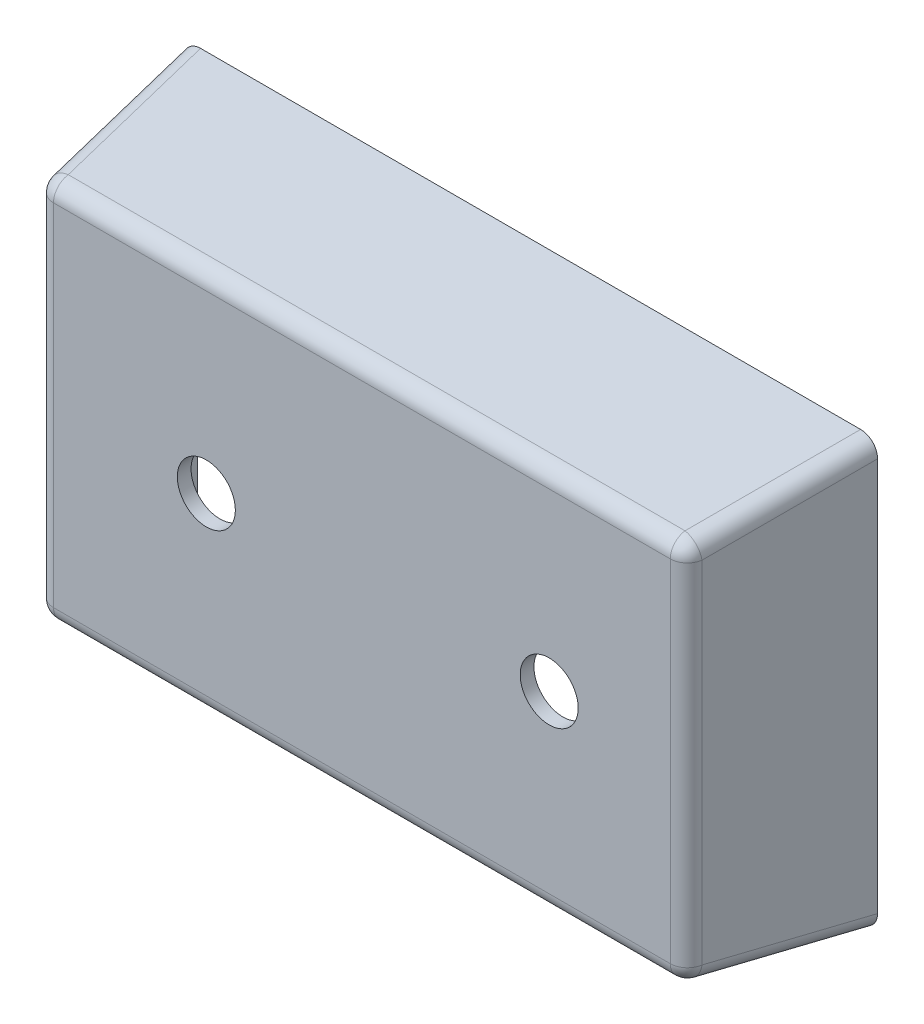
ISO-10303-21;
HEADER;
FILE_DESCRIPTION(('STEP AP214'),'2;1');
FILE_NAME('part.step','',(''),(''),'','','');
FILE_SCHEMA(('AUTOMOTIVE_DESIGN { 1 0 10303 214 1 1 1 1 }'));
ENDSEC;
DATA;
#1=APPLICATION_CONTEXT('core data for automotive mechanical design processes');
#2=APPLICATION_PROTOCOL_DEFINITION('international standard','automotive_design',2000,#1);
#3=PRODUCT_CONTEXT('',#1,'mechanical');
#4=PRODUCT('Part','Part','',(#3));
#5=PRODUCT_RELATED_PRODUCT_CATEGORY('part','',(#4));
#6=PRODUCT_DEFINITION_FORMATION('','',#4);
#7=PRODUCT_DEFINITION_CONTEXT('part definition',#1,'design');
#8=PRODUCT_DEFINITION('design','',#6,#7);
#9=PRODUCT_DEFINITION_SHAPE('','',#8);
#10=(LENGTH_UNIT() NAMED_UNIT(*) SI_UNIT(.MILLI.,.METRE.));
#11=(NAMED_UNIT(*) PLANE_ANGLE_UNIT() SI_UNIT($,.RADIAN.));
#12=(NAMED_UNIT(*) SI_UNIT($,.STERADIAN.) SOLID_ANGLE_UNIT());
#13=UNCERTAINTY_MEASURE_WITH_UNIT(LENGTH_MEASURE(1.E-05),#10,'distance_accuracy_value','');
#14=(GEOMETRIC_REPRESENTATION_CONTEXT(3) GLOBAL_UNCERTAINTY_ASSIGNED_CONTEXT((#13)) GLOBAL_UNIT_ASSIGNED_CONTEXT((#10,
#11,#12)) REPRESENTATION_CONTEXT('',''));
#15=CARTESIAN_POINT('',(0.,0.,0.));
#16=DIRECTION('',(0.,0.,1.));
#17=DIRECTION('',(1.,0.,0.));
#18=AXIS2_PLACEMENT_3D('',#15,#16,#17);
#19=CARTESIAN_POINT('',(-67.2074549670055,39.6131532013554,0.));
#20=DIRECTION('',(-0.99026806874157,0.,0.139173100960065));
#21=DIRECTION('',(0.139173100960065,0.,0.99026806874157));
#22=AXIS2_PLACEMENT_3D('',#19,#20,#21);
#23=PLANE('',#22);
#24=DIRECTION('',(0.,-1.,0.));
#25=VECTOR('',#24,1.);
#26=CARTESIAN_POINT('',(-67.2074549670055,39.6131532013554,0.));
#27=LINE('',#26,#25);
#28=CARTESIAN_POINT('',(-67.2074549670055,36.469052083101,0.));
#29=VERTEX_POINT('',#28);
#30=CARTESIAN_POINT('',(-67.2074549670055,-36.469052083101,0.));
#31=VERTEX_POINT('',#30);
#32=EDGE_CURVE('E278',#29,#31,#27,.T.);
#33=ORIENTED_EDGE('',*,*,#32,.T.);
#34=DIRECTION('',(0.137844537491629,0.137844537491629,0.980814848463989));
#35=VECTOR('',#34,1.);
#36=CARTESIAN_POINT('',(-65.76180811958,-35.0234052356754,10.2863118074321));
#37=LINE('',#36,#35);
#38=CARTESIAN_POINT('',(-63.2007939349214,-32.4623910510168,28.5088745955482));
#39=VERTEX_POINT('',#38);
#40=EDGE_CURVE('E56',#31,#39,#37,.T.);
#41=ORIENTED_EDGE('',*,*,#40,.T.);
#42=DIRECTION('',(0.,-1.,0.));
#43=VECTOR('',#42,1.);
#44=CARTESIAN_POINT('',(-63.2007939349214,35.2223764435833,28.5088745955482));
#45=LINE('',#44,#43);
#46=CARTESIAN_POINT('',(-63.2007939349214,32.4623910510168,28.5088745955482));
#47=VERTEX_POINT('',#46);
#48=EDGE_CURVE('E320',#39,#47,#45,.F.);
#49=ORIENTED_EDGE('',*,*,#48,.T.);
#50=DIRECTION('',(0.137844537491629,-0.137844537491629,0.980814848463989));
#51=VECTOR('',#50,1.);
#52=CARTESIAN_POINT('',(-67.2671963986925,36.5287935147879,-0.425082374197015));
#53=LINE('',#52,#51);
#54=EDGE_CURVE('E318',#47,#29,#53,.F.);
#55=ORIENTED_EDGE('',*,*,#54,.T.);
#56=EDGE_LOOP('',(#33,#41,#49,#55));
#57=FACE_BOUND('',#56,.T.);
#58=ADVANCED_FACE('F31',(#57),#23,.T.);
#59=CARTESIAN_POINT('',(-67.2074549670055,-39.6131532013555,0.));
#60=DIRECTION('',(0.,-0.99026806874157,0.139173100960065));
#61=DIRECTION('',(0.,-0.139173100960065,-0.99026806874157));
#62=AXIS2_PLACEMENT_3D('',#59,#60,#61);
#63=PLANE('',#62);
#64=DIRECTION('',(1.,0.,0.));
#65=VECTOR('',#64,1.);
#66=CARTESIAN_POINT('',(-67.2074549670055,-39.6131532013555,0.));
#67=LINE('',#66,#65);
#68=CARTESIAN_POINT('',(-64.063353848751,-39.6131532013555,0.));
#69=VERTEX_POINT('',#68);
#70=CARTESIAN_POINT('',(58.176569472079,-39.6131532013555,0.));
#71=VERTEX_POINT('',#70);
#72=EDGE_CURVE('E280',#69,#71,#67,.T.);
#73=ORIENTED_EDGE('',*,*,#72,.T.);
#74=DIRECTION('',(-0.137844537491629,0.137844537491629,0.980814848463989));
#75=VECTOR('',#74,1.);
#76=CARTESIAN_POINT('',(55.7941330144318,-37.2307167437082,16.9519162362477));
#77=LINE('',#76,#75);
#78=CARTESIAN_POINT('',(54.1699084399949,-35.6064921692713,28.5088745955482));
#79=VERTEX_POINT('',#78);
#80=EDGE_CURVE('E316',#71,#79,#77,.T.);
#81=ORIENTED_EDGE('',*,*,#80,.T.);
#82=DIRECTION('',(1.,0.,0.));
#83=VECTOR('',#82,1.);
#84=CARTESIAN_POINT('',(-62.8166782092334,-35.6064921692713,28.5088745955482));
#85=LINE('',#84,#83);
#86=CARTESIAN_POINT('',(-60.0566928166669,-35.6064921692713,28.5088745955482));
#87=VERTEX_POINT('',#86);
#88=EDGE_CURVE('E314',#79,#87,#85,.F.);
#89=ORIENTED_EDGE('',*,*,#88,.T.);
#90=DIRECTION('',(0.137844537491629,0.137844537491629,0.980814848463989));
#91=VECTOR('',#90,1.);
#92=CARTESIAN_POINT('',(-64.123095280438,-39.6728946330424,-0.425082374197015));
#93=LINE('',#92,#91);
#94=EDGE_CURVE('E312',#87,#69,#93,.F.);
#95=ORIENTED_EDGE('',*,*,#94,.T.);
#96=EDGE_LOOP('',(#73,#81,#89,#95));
#97=FACE_BOUND('',#96,.T.);
#98=ADVANCED_FACE('F421',(#97),#63,.T.);
#99=CARTESIAN_POINT('',(61.3206705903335,39.6131532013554,0.));
#100=DIRECTION('',(0.99026806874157,0.,0.139173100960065));
#101=DIRECTION('',(0.139173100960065,0.,-0.99026806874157));
#102=AXIS2_PLACEMENT_3D('',#99,#100,#101);
#103=PLANE('',#102);
#104=DIRECTION('',(0.,1.,0.));
#105=VECTOR('',#104,1.);
#106=CARTESIAN_POINT('',(57.3140095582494,-35.2223764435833,28.5088745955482));
#107=LINE('',#106,#105);
#108=CARTESIAN_POINT('',(57.3140095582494,32.4623910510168,28.5088745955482));
#109=VERTEX_POINT('',#108);
#110=CARTESIAN_POINT('',(57.3140095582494,-32.4623910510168,28.5088745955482));
#111=VERTEX_POINT('',#110);
#112=EDGE_CURVE('E308',#109,#111,#107,.F.);
#113=ORIENTED_EDGE('',*,*,#112,.T.);
#114=DIRECTION('',(-0.137844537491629,0.137844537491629,0.980814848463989));
#115=VECTOR('',#114,1.);
#116=CARTESIAN_POINT('',(59.875023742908,-35.0234052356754,10.2863118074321));
#117=LINE('',#116,#115);
#118=CARTESIAN_POINT('',(61.3206705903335,-36.469052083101,0.));
#119=VERTEX_POINT('',#118);
#120=EDGE_CURVE('E310',#111,#119,#117,.F.);
#121=ORIENTED_EDGE('',*,*,#120,.T.);
#122=DIRECTION('',(0.,1.,0.));
#123=VECTOR('',#122,1.);
#124=CARTESIAN_POINT('',(61.3206705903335,39.6131532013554,0.));
#125=LINE('',#124,#123);
#126=CARTESIAN_POINT('',(61.3206705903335,36.469052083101,0.));
#127=VERTEX_POINT('',#126);
#128=EDGE_CURVE('E284',#119,#127,#125,.T.);
#129=ORIENTED_EDGE('',*,*,#128,.T.);
#130=DIRECTION('',(-0.137844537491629,-0.137844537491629,0.980814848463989));
#131=VECTOR('',#130,1.);
#132=CARTESIAN_POINT('',(61.3804120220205,36.5287935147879,-0.425082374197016));
#133=LINE('',#132,#131);
#134=EDGE_CURVE('E306',#127,#109,#133,.T.);
#135=ORIENTED_EDGE('',*,*,#134,.T.);
#136=EDGE_LOOP('',(#113,#121,#129,#135));
#137=FACE_BOUND('',#136,.T.);
#138=ADVANCED_FACE('F446',(#137),#103,.T.);
#139=CARTESIAN_POINT('',(-67.2074549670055,39.6131532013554,0.));
#140=DIRECTION('',(0.,0.99026806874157,0.139173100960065));
#141=DIRECTION('',(0.,-0.139173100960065,0.99026806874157));
#142=AXIS2_PLACEMENT_3D('',#139,#140,#141);
#143=PLANE('',#142);
#144=DIRECTION('',(-1.,0.,0.));
#145=VECTOR('',#144,1.);
#146=CARTESIAN_POINT('',(56.9298938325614,35.6064921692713,28.5088745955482));
#147=LINE('',#146,#145);
#148=CARTESIAN_POINT('',(-60.0566928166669,35.6064921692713,28.5088745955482));
#149=VERTEX_POINT('',#148);
#150=CARTESIAN_POINT('',(54.1699084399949,35.6064921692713,28.5088745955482));
#151=VERTEX_POINT('',#150);
#152=EDGE_CURVE('E301',#149,#151,#147,.F.);
#153=ORIENTED_EDGE('',*,*,#152,.T.);
#154=DIRECTION('',(-0.137844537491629,-0.137844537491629,0.980814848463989));
#155=VECTOR('',#154,1.);
#156=CARTESIAN_POINT('',(55.7941330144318,37.2307167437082,16.9519162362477));
#157=LINE('',#156,#155);
#158=CARTESIAN_POINT('',(58.1765694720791,39.6131532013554,0.));
#159=VERTEX_POINT('',#158);
#160=EDGE_CURVE('E304',#151,#159,#157,.F.);
#161=ORIENTED_EDGE('',*,*,#160,.T.);
#162=DIRECTION('',(-1.,0.,0.));
#163=VECTOR('',#162,1.);
#164=CARTESIAN_POINT('',(-67.2074549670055,39.6131532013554,0.));
#165=LINE('',#164,#163);
#166=CARTESIAN_POINT('',(-64.063353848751,39.6131532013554,0.));
#167=VERTEX_POINT('',#166);
#168=EDGE_CURVE('E287',#159,#167,#165,.T.);
#169=ORIENTED_EDGE('',*,*,#168,.T.);
#170=DIRECTION('',(0.137844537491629,-0.137844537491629,0.980814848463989));
#171=VECTOR('',#170,1.);
#172=CARTESIAN_POINT('',(-64.123095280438,39.6728946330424,-0.425082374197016));
#173=LINE('',#172,#171);
#174=EDGE_CURVE('E299',#167,#149,#173,.T.);
#175=ORIENTED_EDGE('',*,*,#174,.T.);
#176=EDGE_LOOP('',(#153,#161,#169,#175));
#177=FACE_BOUND('',#176,.T.);
#178=ADVANCED_FACE('F379',(#177),#143,.T.);
#179=CARTESIAN_POINT('',(-67.2074549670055,-39.6131532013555,31.242));
#180=DIRECTION('',(0.,0.,1.));
#181=DIRECTION('',(1.,0.,0.));
#182=AXIS2_PLACEMENT_3D('',#179,#180,#181);
#183=PLANE('',#182);
#184=CARTESIAN_POINT('',(31.75,0.,31.242));
#185=DIRECTION('',(0.,0.,1.));
#186=DIRECTION('',(1.,0.,0.));
#187=AXIS2_PLACEMENT_3D('',#184,#185,#186);
#188=CIRCLE('',#187,5.37299654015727);
#189=CARTESIAN_POINT('',(37.1229965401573,0.,31.242));
#190=VERTEX_POINT('',#189);
#191=EDGE_CURVE('E367',#190,#190,#188,.T.);
#192=ORIENTED_EDGE('',*,*,#191,.F.);
#193=EDGE_LOOP('',(#192));
#194=FACE_BOUND('',#193,.T.);
#195=CARTESIAN_POINT('',(-31.75,0.,31.242));
#196=DIRECTION('',(0.,0.,1.));
#197=DIRECTION('',(1.,0.,0.));
#198=AXIS2_PLACEMENT_3D('',#195,#196,#197);
#199=CIRCLE('',#198,5.37299654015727);
#200=CARTESIAN_POINT('',(-26.3770034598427,0.,31.242));
#201=VERTEX_POINT('',#200);
#202=EDGE_CURVE('E360',#201,#201,#199,.T.);
#203=ORIENTED_EDGE('',*,*,#202,.F.);
#204=EDGE_LOOP('',(#203));
#205=FACE_BOUND('',#204,.T.);
#206=DIRECTION('',(0.,-1.,0.));
#207=VECTOR('',#206,1.);
#208=CARTESIAN_POINT('',(54.1699084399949,35.2223764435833,31.242));
#209=LINE('',#208,#207);
#210=CARTESIAN_POINT('',(54.1699084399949,-32.4623910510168,31.242));
#211=VERTEX_POINT('',#210);
#212=CARTESIAN_POINT('',(54.1699084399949,32.4623910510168,31.242));
#213=VERTEX_POINT('',#212);
#214=EDGE_CURVE('E294',#211,#213,#209,.F.);
#215=ORIENTED_EDGE('',*,*,#214,.T.);
#216=DIRECTION('',(1.,0.,0.));
#217=VECTOR('',#216,1.);
#218=CARTESIAN_POINT('',(-62.8166782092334,32.4623910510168,31.242));
#219=LINE('',#218,#217);
#220=CARTESIAN_POINT('',(-60.0566928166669,32.4623910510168,31.242));
#221=VERTEX_POINT('',#220);
#222=EDGE_CURVE('E296',#213,#221,#219,.F.);
#223=ORIENTED_EDGE('',*,*,#222,.T.);
#224=DIRECTION('',(0.,1.,0.));
#225=VECTOR('',#224,1.);
#226=CARTESIAN_POINT('',(-60.0566928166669,-35.2223764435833,31.242));
#227=LINE('',#226,#225);
#228=CARTESIAN_POINT('',(-60.0566928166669,-32.4623910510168,31.242));
#229=VERTEX_POINT('',#228);
#230=EDGE_CURVE('E290',#221,#229,#227,.F.);
#231=ORIENTED_EDGE('',*,*,#230,.T.);
#232=DIRECTION('',(-1.,0.,0.));
#233=VECTOR('',#232,1.);
#234=CARTESIAN_POINT('',(56.9298938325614,-32.4623910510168,31.242));
#235=LINE('',#234,#233);
#236=EDGE_CURVE('E292',#229,#211,#235,.F.);
#237=ORIENTED_EDGE('',*,*,#236,.T.);
#238=EDGE_LOOP('',(#215,#223,#231,#237));
#239=FACE_BOUND('',#238,.T.);
#240=ADVANCED_FACE('F375',(#194,#205,#239),#183,.T.);
#241=CARTESIAN_POINT('',(-67.2074549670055,-39.6131532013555,0.));
#242=DIRECTION('',(0.,0.,1.));
#243=DIRECTION('',(1.,0.,0.));
#244=AXIS2_PLACEMENT_3D('',#241,#242,#243);
#245=PLANE('',#244);
#246=CARTESIAN_POINT('',(58.1144680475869,-36.4069506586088,0.));
#247=DIRECTION('',(0.,0.,1.));
#248=DIRECTION('',(0.707106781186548,-0.707106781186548,0.));
#249=AXIS2_PLACEMENT_3D('',#246,#247,#248);
#250=ELLIPSE('',#249,0.647420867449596,0.635);
#251=CARTESIAN_POINT('',(58.7557085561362,-36.4193709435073,0.));
#252=VERTEX_POINT('',#251);
#253=CARTESIAN_POINT('',(58.1268883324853,-37.0481911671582,0.));
#254=VERTEX_POINT('',#253);
#255=EDGE_CURVE('E270',#252,#254,#250,.F.);
#256=ORIENTED_EDGE('',*,*,#255,.F.);
#257=DIRECTION('',(0.,-1.,0.));
#258=VECTOR('',#257,1.);
#259=CARTESIAN_POINT('',(58.7557085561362,39.6131532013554,0.));
#260=LINE('',#259,#258);
#261=CARTESIAN_POINT('',(58.7557085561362,36.4193709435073,0.));
#262=VERTEX_POINT('',#261);
#263=EDGE_CURVE('E267',#252,#262,#260,.F.);
#264=ORIENTED_EDGE('',*,*,#263,.T.);
#265=CARTESIAN_POINT('',(58.1144680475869,36.4069506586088,0.));
#266=DIRECTION('',(0.,0.,1.));
#267=DIRECTION('',(0.707106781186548,0.707106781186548,0.));
#268=AXIS2_PLACEMENT_3D('',#265,#266,#267);
#269=ELLIPSE('',#268,0.647420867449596,0.635);
#270=CARTESIAN_POINT('',(58.1268883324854,37.0481911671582,0.));
#271=VERTEX_POINT('',#270);
#272=EDGE_CURVE('E268',#271,#262,#269,.F.);
#273=ORIENTED_EDGE('',*,*,#272,.F.);
#274=DIRECTION('',(1.,0.,0.));
#275=VECTOR('',#274,1.);
#276=CARTESIAN_POINT('',(-67.2074549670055,37.0481911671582,0.));
#277=LINE('',#276,#275);
#278=CARTESIAN_POINT('',(-64.0136727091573,37.0481911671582,0.));
#279=VERTEX_POINT('',#278);
#280=EDGE_CURVE('E48',#271,#279,#277,.F.);
#281=ORIENTED_EDGE('',*,*,#280,.T.);
#282=CARTESIAN_POINT('',(-64.0012524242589,36.4069506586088,0.));
#283=DIRECTION('',(0.,0.,1.));
#284=DIRECTION('',(-0.707106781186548,0.707106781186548,0.));
#285=AXIS2_PLACEMENT_3D('',#282,#283,#284);
#286=ELLIPSE('',#285,0.647420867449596,0.635);
#287=CARTESIAN_POINT('',(-64.6424929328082,36.4193709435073,0.));
#288=VERTEX_POINT('',#287);
#289=EDGE_CURVE('E182',#288,#279,#286,.F.);
#290=ORIENTED_EDGE('',*,*,#289,.F.);
#291=DIRECTION('',(0.,1.,0.));
#292=VECTOR('',#291,1.);
#293=CARTESIAN_POINT('',(-64.6424929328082,39.6131532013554,0.));
#294=LINE('',#293,#292);
#295=CARTESIAN_POINT('',(-64.6424929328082,-36.4193709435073,0.));
#296=VERTEX_POINT('',#295);
#297=EDGE_CURVE('E223',#288,#296,#294,.F.);
#298=ORIENTED_EDGE('',*,*,#297,.T.);
#299=CARTESIAN_POINT('',(-64.0012524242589,-36.4069506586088,0.));
#300=DIRECTION('',(0.,0.,1.));
#301=DIRECTION('',(-0.707106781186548,-0.707106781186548,0.));
#302=AXIS2_PLACEMENT_3D('',#299,#300,#301);
#303=ELLIPSE('',#302,0.647420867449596,0.635);
#304=CARTESIAN_POINT('',(-64.0136727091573,-37.0481911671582,0.));
#305=VERTEX_POINT('',#304);
#306=EDGE_CURVE('E177',#305,#296,#303,.F.);
#307=ORIENTED_EDGE('',*,*,#306,.F.);
#308=DIRECTION('',(-1.,0.,0.));
#309=VECTOR('',#308,1.);
#310=CARTESIAN_POINT('',(-67.2074549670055,-37.0481911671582,0.));
#311=LINE('',#310,#309);
#312=EDGE_CURVE('E264',#305,#254,#311,.F.);
#313=ORIENTED_EDGE('',*,*,#312,.T.);
#314=EDGE_LOOP('',(#256,#264,#273,#281,#290,#298,#307,#313));
#315=FACE_BOUND('',#314,.T.);
#316=ORIENTED_EDGE('',*,*,#128,.F.);
#317=CARTESIAN_POINT('',(58.1144680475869,-36.4069506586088,0.));
#318=DIRECTION('',(0.,0.,1.));
#319=DIRECTION('',(0.707106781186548,-0.707106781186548,0.));
#320=AXIS2_PLACEMENT_3D('',#317,#318,#319);
#321=ELLIPSE('',#320,3.23710433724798,3.175);
#322=EDGE_CURVE('E11',#119,#71,#321,.F.);
#323=ORIENTED_EDGE('',*,*,#322,.T.);
#324=ORIENTED_EDGE('',*,*,#72,.F.);
#325=CARTESIAN_POINT('',(-64.0012524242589,-36.4069506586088,0.));
#326=DIRECTION('',(0.,0.,1.));
#327=DIRECTION('',(-0.707106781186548,-0.707106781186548,0.));
#328=AXIS2_PLACEMENT_3D('',#325,#326,#327);
#329=ELLIPSE('',#328,3.23710433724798,3.175);
#330=EDGE_CURVE('E325',#69,#31,#329,.F.);
#331=ORIENTED_EDGE('',*,*,#330,.T.);
#332=ORIENTED_EDGE('',*,*,#32,.F.);
#333=CARTESIAN_POINT('',(-64.0012524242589,36.4069506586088,0.));
#334=DIRECTION('',(0.,0.,1.));
#335=DIRECTION('',(-0.707106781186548,0.707106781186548,0.));
#336=AXIS2_PLACEMENT_3D('',#333,#334,#335);
#337=ELLIPSE('',#336,3.23710433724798,3.175);
#338=EDGE_CURVE('E323',#29,#167,#337,.F.);
#339=ORIENTED_EDGE('',*,*,#338,.T.);
#340=ORIENTED_EDGE('',*,*,#168,.F.);
#341=CARTESIAN_POINT('',(58.1144680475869,36.4069506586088,0.));
#342=DIRECTION('',(0.,0.,1.));
#343=DIRECTION('',(0.707106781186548,0.707106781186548,0.));
#344=AXIS2_PLACEMENT_3D('',#341,#342,#343);
#345=ELLIPSE('',#344,3.23710433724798,3.175);
#346=EDGE_CURVE('E40',#159,#127,#345,.F.);
#347=ORIENTED_EDGE('',*,*,#346,.T.);
#348=EDGE_LOOP('',(#316,#323,#324,#331,#332,#339,#340,#347));
#349=FACE_BOUND('',#348,.T.);
#350=ADVANCED_FACE('F378',(#315,#349),#245,.F.);
#351=CARTESIAN_POINT('',(56.7309226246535,-35.0234052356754,9.84443721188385));
#352=DIRECTION('',(0.137844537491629,-0.137844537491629,-0.980814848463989));
#353=DIRECTION('',(-0.99026806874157,0.,-0.139173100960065));
#354=AXIS2_PLACEMENT_3D('',#351,#352,#353);
#355=CYLINDRICAL_SURFACE('',#354,3.175);
#356=ORIENTED_EDGE('',*,*,#322,.F.);
#357=ORIENTED_EDGE('',*,*,#120,.F.);
#358=CARTESIAN_POINT('',(54.1699084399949,-32.4623910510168,28.067));
#359=DIRECTION('',(-0.137844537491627,0.137844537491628,0.98081484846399));
#360=DIRECTION('',(0.,-0.99026806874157,0.139173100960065));
#361=AXIS2_PLACEMENT_3D('',#358,#359,#360);
#362=CIRCLE('',#361,3.175);
#363=EDGE_CURVE('E281',#79,#111,#362,.T.);
#364=ORIENTED_EDGE('',*,*,#363,.F.);
#365=ORIENTED_EDGE('',*,*,#80,.F.);
#366=EDGE_LOOP('',(#356,#357,#364,#365));
#367=FACE_BOUND('',#366,.T.);
#368=ADVANCED_FACE('F33',(#367),#355,.T.);
#369=CARTESIAN_POINT('',(-67.2074549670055,-32.4623910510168,28.067));
#370=DIRECTION('',(1.,0.,0.));
#371=DIRECTION('',(0.,0.,-1.));
#372=AXIS2_PLACEMENT_3D('',#369,#370,#371);
#373=CYLINDRICAL_SURFACE('',#372,3.175);
#374=CARTESIAN_POINT('',(-60.0566928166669,-32.4623910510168,28.067));
#375=DIRECTION('',(-1.,0.,0.));
#376=DIRECTION('',(0.,0.,1.));
#377=AXIS2_PLACEMENT_3D('',#374,#375,#376);
#378=CIRCLE('',#377,3.175);
#379=EDGE_CURVE('E352',#87,#229,#378,.T.);
#380=ORIENTED_EDGE('',*,*,#379,.F.);
#381=ORIENTED_EDGE('',*,*,#88,.F.);
#382=CARTESIAN_POINT('',(54.1699084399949,-32.4623910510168,28.067));
#383=DIRECTION('',(1.,0.,0.));
#384=DIRECTION('',(0.,1.,0.));
#385=AXIS2_PLACEMENT_3D('',#382,#383,#384);
#386=CIRCLE('',#385,3.175);
#387=EDGE_CURVE('E355',#211,#79,#386,.T.);
#388=ORIENTED_EDGE('',*,*,#387,.F.);
#389=ORIENTED_EDGE('',*,*,#236,.F.);
#390=EDGE_LOOP('',(#380,#381,#388,#389));
#391=FACE_BOUND('',#390,.T.);
#392=ADVANCED_FACE('F410',(#391),#373,.T.);
#393=CARTESIAN_POINT('',(-64.123095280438,-36.5287935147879,-0.866956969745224));
#394=DIRECTION('',(-0.137844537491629,-0.137844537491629,-0.980814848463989));
#395=DIRECTION('',(-0.99026806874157,0.,0.139173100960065));
#396=AXIS2_PLACEMENT_3D('',#393,#394,#395);
#397=CYLINDRICAL_SURFACE('',#396,3.175);
#398=ORIENTED_EDGE('',*,*,#330,.F.);
#399=ORIENTED_EDGE('',*,*,#94,.F.);
#400=CARTESIAN_POINT('',(-60.0566928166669,-32.4623910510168,28.067));
#401=DIRECTION('',(0.137844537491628,0.137844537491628,0.980814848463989));
#402=DIRECTION('',(0.99026806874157,0.,-0.139173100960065));
#403=AXIS2_PLACEMENT_3D('',#400,#401,#402);
#404=CIRCLE('',#403,3.175);
#405=EDGE_CURVE('E349',#39,#87,#404,.T.);
#406=ORIENTED_EDGE('',*,*,#405,.F.);
#407=ORIENTED_EDGE('',*,*,#40,.F.);
#408=EDGE_LOOP('',(#398,#399,#406,#407));
#409=FACE_BOUND('',#408,.T.);
#410=ADVANCED_FACE('F418',(#409),#397,.T.);
#411=CARTESIAN_POINT('',(54.1699084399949,-32.4623910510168,28.067));
#412=DIRECTION('',(0.,0.,1.));
#413=DIRECTION('',(1.,0.,0.));
#414=AXIS2_PLACEMENT_3D('',#411,#412,#413);
#415=SPHERICAL_SURFACE('',#414,3.175);
#416=ORIENTED_EDGE('',*,*,#387,.T.);
#417=ORIENTED_EDGE('',*,*,#363,.T.);
#418=CARTESIAN_POINT('',(54.1699084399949,-32.4623910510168,28.067));
#419=DIRECTION('',(0.,-1.,0.));
#420=DIRECTION('',(0.,0.,-1.));
#421=AXIS2_PLACEMENT_3D('',#418,#419,#420);
#422=CIRCLE('',#421,3.175);
#423=EDGE_CURVE('E346',#211,#111,#422,.F.);
#424=ORIENTED_EDGE('',*,*,#423,.F.);
#425=EDGE_LOOP('',(#416,#417,#424));
#426=FACE_BOUND('',#425,.T.);
#427=ADVANCED_FACE('F431',(#426),#415,.T.);
#428=CARTESIAN_POINT('',(-60.0566928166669,-32.4623910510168,28.067));
#429=DIRECTION('',(0.,0.,1.));
#430=DIRECTION('',(1.,0.,0.));
#431=AXIS2_PLACEMENT_3D('',#428,#429,#430);
#432=SPHERICAL_SURFACE('',#431,3.175);
#433=ORIENTED_EDGE('',*,*,#405,.T.);
#434=ORIENTED_EDGE('',*,*,#379,.T.);
#435=CARTESIAN_POINT('',(-60.0566928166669,-32.4623910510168,28.067));
#436=DIRECTION('',(0.,-1.,0.));
#437=DIRECTION('',(0.,0.,-1.));
#438=AXIS2_PLACEMENT_3D('',#435,#436,#437);
#439=CIRCLE('',#438,3.175);
#440=EDGE_CURVE('E343',#39,#229,#439,.F.);
#441=ORIENTED_EDGE('',*,*,#440,.F.);
#442=EDGE_LOOP('',(#433,#434,#441));
#443=FACE_BOUND('',#442,.T.);
#444=ADVANCED_FACE('F414',(#443),#432,.T.);
#445=CARTESIAN_POINT('',(55.7941330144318,34.0866156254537,16.5100416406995));
#446=DIRECTION('',(0.137844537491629,0.137844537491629,-0.980814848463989));
#447=DIRECTION('',(-0.99026806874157,0.,-0.139173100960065));
#448=AXIS2_PLACEMENT_3D('',#445,#446,#447);
#449=CYLINDRICAL_SURFACE('',#448,3.175);
#450=ORIENTED_EDGE('',*,*,#346,.F.);
#451=ORIENTED_EDGE('',*,*,#160,.F.);
#452=CARTESIAN_POINT('',(54.1699084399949,32.4623910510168,28.067));
#453=DIRECTION('',(-0.137844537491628,-0.137844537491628,0.980814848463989));
#454=DIRECTION('',(0.99026806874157,0.,0.139173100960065));
#455=AXIS2_PLACEMENT_3D('',#452,#453,#454);
#456=CIRCLE('',#455,3.175);
#457=EDGE_CURVE('E340',#109,#151,#456,.T.);
#458=ORIENTED_EDGE('',*,*,#457,.F.);
#459=ORIENTED_EDGE('',*,*,#134,.F.);
#460=EDGE_LOOP('',(#450,#451,#458,#459));
#461=FACE_BOUND('',#460,.T.);
#462=ADVANCED_FACE('F438',(#461),#449,.T.);
#463=CARTESIAN_POINT('',(54.1699084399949,-39.6131532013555,28.067));
#464=DIRECTION('',(0.,1.,0.));
#465=DIRECTION('',(0.,0.,1.));
#466=AXIS2_PLACEMENT_3D('',#463,#464,#465);
#467=CYLINDRICAL_SURFACE('',#466,3.175);
#468=ORIENTED_EDGE('',*,*,#423,.T.);
#469=ORIENTED_EDGE('',*,*,#112,.F.);
#470=CARTESIAN_POINT('',(54.1699084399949,32.4623910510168,28.067));
#471=DIRECTION('',(0.,1.,0.));
#472=DIRECTION('',(-1.,0.,0.));
#473=AXIS2_PLACEMENT_3D('',#470,#471,#472);
#474=CIRCLE('',#473,3.175);
#475=EDGE_CURVE('E337',#213,#109,#474,.T.);
#476=ORIENTED_EDGE('',*,*,#475,.F.);
#477=ORIENTED_EDGE('',*,*,#214,.F.);
#478=EDGE_LOOP('',(#468,#469,#476,#477));
#479=FACE_BOUND('',#478,.T.);
#480=ADVANCED_FACE('F390',(#479),#467,.T.);
#481=CARTESIAN_POINT('',(-60.0566928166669,-39.6131532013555,28.067));
#482=DIRECTION('',(0.,-1.,0.));
#483=DIRECTION('',(0.,0.,-1.));
#484=AXIS2_PLACEMENT_3D('',#481,#482,#483);
#485=CYLINDRICAL_SURFACE('',#484,3.175);
#486=ORIENTED_EDGE('',*,*,#440,.T.);
#487=ORIENTED_EDGE('',*,*,#230,.F.);
#488=CARTESIAN_POINT('',(-60.0566928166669,32.4623910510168,28.067));
#489=DIRECTION('',(0.,1.,0.));
#490=DIRECTION('',(0.,0.,1.));
#491=AXIS2_PLACEMENT_3D('',#488,#489,#490);
#492=CIRCLE('',#491,3.175);
#493=EDGE_CURVE('E334',#47,#221,#492,.T.);
#494=ORIENTED_EDGE('',*,*,#493,.F.);
#495=ORIENTED_EDGE('',*,*,#48,.F.);
#496=EDGE_LOOP('',(#486,#487,#494,#495));
#497=FACE_BOUND('',#496,.T.);
#498=ADVANCED_FACE('F406',(#497),#485,.T.);
#499=CARTESIAN_POINT('',(-64.123095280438,36.5287935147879,-0.866956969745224));
#500=DIRECTION('',(-0.137844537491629,0.137844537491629,-0.980814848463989));
#501=DIRECTION('',(-0.99026806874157,0.,0.139173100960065));
#502=AXIS2_PLACEMENT_3D('',#499,#500,#501);
#503=CYLINDRICAL_SURFACE('',#502,3.175);
#504=ORIENTED_EDGE('',*,*,#338,.F.);
#505=ORIENTED_EDGE('',*,*,#54,.F.);
#506=CARTESIAN_POINT('',(-60.0566928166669,32.4623910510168,28.067));
#507=DIRECTION('',(0.137844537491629,-0.137844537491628,0.980814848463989));
#508=DIRECTION('',(0.99026806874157,0.,-0.139173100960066));
#509=AXIS2_PLACEMENT_3D('',#506,#507,#508);
#510=CIRCLE('',#509,3.175);
#511=EDGE_CURVE('E331',#149,#47,#510,.T.);
#512=ORIENTED_EDGE('',*,*,#511,.F.);
#513=ORIENTED_EDGE('',*,*,#174,.F.);
#514=EDGE_LOOP('',(#504,#505,#512,#513));
#515=FACE_BOUND('',#514,.T.);
#516=ADVANCED_FACE('F462',(#515),#503,.T.);
#517=CARTESIAN_POINT('',(54.1699084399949,32.4623910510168,28.067));
#518=DIRECTION('',(0.,0.,1.));
#519=DIRECTION('',(1.,0.,0.));
#520=AXIS2_PLACEMENT_3D('',#517,#518,#519);
#521=SPHERICAL_SURFACE('',#520,3.175);
#522=ORIENTED_EDGE('',*,*,#475,.T.);
#523=ORIENTED_EDGE('',*,*,#457,.T.);
#524=CARTESIAN_POINT('',(54.1699084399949,32.4623910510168,28.067));
#525=DIRECTION('',(1.,0.,0.));
#526=DIRECTION('',(0.,0.,-1.));
#527=AXIS2_PLACEMENT_3D('',#524,#525,#526);
#528=CIRCLE('',#527,3.175);
#529=EDGE_CURVE('E329',#213,#151,#528,.F.);
#530=ORIENTED_EDGE('',*,*,#529,.F.);
#531=EDGE_LOOP('',(#522,#523,#530));
#532=FACE_BOUND('',#531,.T.);
#533=ADVANCED_FACE('F393',(#532),#521,.T.);
#534=CARTESIAN_POINT('',(-60.0566928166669,32.4623910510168,28.067));
#535=DIRECTION('',(0.,0.,1.));
#536=DIRECTION('',(1.,0.,0.));
#537=AXIS2_PLACEMENT_3D('',#534,#535,#536);
#538=SPHERICAL_SURFACE('',#537,3.175);
#539=ORIENTED_EDGE('',*,*,#511,.T.);
#540=ORIENTED_EDGE('',*,*,#493,.T.);
#541=CARTESIAN_POINT('',(-60.0566928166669,32.4623910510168,28.067));
#542=DIRECTION('',(-1.,0.,0.));
#543=DIRECTION('',(0.,0.,1.));
#544=AXIS2_PLACEMENT_3D('',#541,#542,#543);
#545=CIRCLE('',#544,3.175);
#546=EDGE_CURVE('E274',#149,#221,#545,.F.);
#547=ORIENTED_EDGE('',*,*,#546,.F.);
#548=EDGE_LOOP('',(#539,#540,#547));
#549=FACE_BOUND('',#548,.T.);
#550=ADVANCED_FACE('F402',(#549),#538,.T.);
#551=CARTESIAN_POINT('',(-67.2074549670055,32.4623910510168,28.067));
#552=DIRECTION('',(-1.,0.,0.));
#553=DIRECTION('',(0.,0.,1.));
#554=AXIS2_PLACEMENT_3D('',#551,#552,#553);
#555=CYLINDRICAL_SURFACE('',#554,3.175);
#556=ORIENTED_EDGE('',*,*,#529,.T.);
#557=ORIENTED_EDGE('',*,*,#152,.F.);
#558=ORIENTED_EDGE('',*,*,#546,.T.);
#559=ORIENTED_EDGE('',*,*,#222,.F.);
#560=EDGE_LOOP('',(#556,#557,#558,#559));
#561=FACE_BOUND('',#560,.T.);
#562=ADVANCED_FACE('F397',(#561),#555,.T.);
#563=CARTESIAN_POINT('',(-64.6921740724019,39.6131532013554,-0.353499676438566));
#564=DIRECTION('',(-0.99026806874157,0.,0.139173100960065));
#565=DIRECTION('',(0.139173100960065,0.,0.99026806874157));
#566=AXIS2_PLACEMENT_3D('',#563,#564,#565);
#567=PLANE('',#566);
#568=ORIENTED_EDGE('',*,*,#297,.F.);
#569=DIRECTION('',(-0.137844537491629,0.137844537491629,-0.980814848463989));
#570=VECTOR('',#569,1.);
#571=CARTESIAN_POINT('',(-64.7519155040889,36.5287935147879,-0.778582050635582));
#572=LINE('',#571,#570);
#573=CARTESIAN_POINT('',(-60.6855130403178,32.4623910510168,28.1553749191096));
#574=VERTEX_POINT('',#573);
#575=EDGE_CURVE('E205',#574,#288,#572,.T.);
#576=ORIENTED_EDGE('',*,*,#575,.F.);
#577=DIRECTION('',(0.,1.,0.));
#578=VECTOR('',#577,1.);
#579=CARTESIAN_POINT('',(-60.6855130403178,39.6131532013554,28.1553749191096));
#580=LINE('',#579,#578);
#581=CARTESIAN_POINT('',(-60.6855130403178,-32.4623910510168,28.1553749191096));
#582=VERTEX_POINT('',#581);
#583=EDGE_CURVE('E183',#582,#574,#580,.T.);
#584=ORIENTED_EDGE('',*,*,#583,.F.);
#585=DIRECTION('',(0.137844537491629,0.137844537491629,0.980814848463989));
#586=VECTOR('',#585,1.);
#587=CARTESIAN_POINT('',(-63.2465272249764,-35.0234052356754,9.93281213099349));
#588=LINE('',#587,#586);
#589=EDGE_CURVE('E172',#296,#582,#588,.T.);
#590=ORIENTED_EDGE('',*,*,#589,.F.);
#591=EDGE_LOOP('',(#568,#576,#584,#590));
#592=FACE_BOUND('',#591,.T.);
#593=ADVANCED_FACE('F204',(#592),#567,.F.);
#594=CARTESIAN_POINT('',(-67.2074549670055,-37.0978723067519,-0.353499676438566));
#595=DIRECTION('',(0.,-0.99026806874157,0.139173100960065));
#596=DIRECTION('',(0.,-0.139173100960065,-0.99026806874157));
#597=AXIS2_PLACEMENT_3D('',#594,#595,#596);
#598=PLANE('',#597);
#599=ORIENTED_EDGE('',*,*,#312,.F.);
#600=DIRECTION('',(-0.137844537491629,-0.137844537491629,-0.980814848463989));
#601=VECTOR('',#600,1.);
#602=CARTESIAN_POINT('',(-64.123095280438,-37.1576137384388,-0.778582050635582));
#603=LINE('',#602,#601);
#604=CARTESIAN_POINT('',(-60.0566928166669,-33.0912112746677,28.1553749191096));
#605=VERTEX_POINT('',#604);
#606=EDGE_CURVE('E212',#605,#305,#603,.T.);
#607=ORIENTED_EDGE('',*,*,#606,.F.);
#608=DIRECTION('',(1.,0.,0.));
#609=VECTOR('',#608,1.);
#610=CARTESIAN_POINT('',(-67.2074549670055,-33.0912112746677,28.1553749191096));
#611=LINE('',#610,#609);
#612=CARTESIAN_POINT('',(54.1699084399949,-33.0912112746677,28.1553749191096));
#613=VERTEX_POINT('',#612);
#614=EDGE_CURVE('E213',#613,#605,#611,.F.);
#615=ORIENTED_EDGE('',*,*,#614,.F.);
#616=DIRECTION('',(0.137844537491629,-0.137844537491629,-0.980814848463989));
#617=VECTOR('',#616,1.);
#618=CARTESIAN_POINT('',(56.7309226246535,-35.6522254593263,9.9328121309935));
#619=LINE('',#618,#617);
#620=EDGE_CURVE('E208',#254,#613,#619,.F.);
#621=ORIENTED_EDGE('',*,*,#620,.F.);
#622=EDGE_LOOP('',(#599,#607,#615,#621));
#623=FACE_BOUND('',#622,.T.);
#624=ADVANCED_FACE('F513',(#623),#598,.F.);
#625=CARTESIAN_POINT('',(58.8053896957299,39.6131532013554,-0.353499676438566));
#626=DIRECTION('',(0.99026806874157,0.,0.139173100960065));
#627=DIRECTION('',(0.139173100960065,0.,-0.99026806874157));
#628=AXIS2_PLACEMENT_3D('',#625,#626,#627);
#629=PLANE('',#628);
#630=DIRECTION('',(0.,1.,0.));
#631=VECTOR('',#630,1.);
#632=CARTESIAN_POINT('',(54.7987286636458,39.6131532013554,28.1553749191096));
#633=LINE('',#632,#631);
#634=CARTESIAN_POINT('',(54.7987286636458,32.4623910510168,28.1553749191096));
#635=VERTEX_POINT('',#634);
#636=CARTESIAN_POINT('',(54.7987286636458,-32.4623910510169,28.1553749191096));
#637=VERTEX_POINT('',#636);
#638=EDGE_CURVE('E219',#635,#637,#633,.F.);
#639=ORIENTED_EDGE('',*,*,#638,.F.);
#640=DIRECTION('',(0.137844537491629,0.137844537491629,-0.980814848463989));
#641=VECTOR('',#640,1.);
#642=CARTESIAN_POINT('',(56.4229532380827,34.0866156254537,16.5984165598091));
#643=LINE('',#642,#641);
#644=EDGE_CURVE('E226',#262,#635,#643,.F.);
#645=ORIENTED_EDGE('',*,*,#644,.F.);
#646=ORIENTED_EDGE('',*,*,#263,.F.);
#647=DIRECTION('',(0.137844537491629,-0.137844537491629,-0.980814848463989));
#648=VECTOR('',#647,1.);
#649=CARTESIAN_POINT('',(57.3597428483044,-35.0234052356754,9.9328121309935));
#650=LINE('',#649,#648);
#651=EDGE_CURVE('E214',#637,#252,#650,.T.);
#652=ORIENTED_EDGE('',*,*,#651,.F.);
#653=EDGE_LOOP('',(#639,#645,#646,#652));
#654=FACE_BOUND('',#653,.T.);
#655=ADVANCED_FACE('F520',(#654),#629,.F.);
#656=CARTESIAN_POINT('',(-67.2074549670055,37.0978723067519,-0.353499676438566));
#657=DIRECTION('',(0.,0.99026806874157,0.139173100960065));
#658=DIRECTION('',(0.,-0.139173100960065,0.99026806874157));
#659=AXIS2_PLACEMENT_3D('',#656,#657,#658);
#660=PLANE('',#659);
#661=DIRECTION('',(1.,0.,0.));
#662=VECTOR('',#661,1.);
#663=CARTESIAN_POINT('',(-67.2074549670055,33.0912112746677,28.1553749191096));
#664=LINE('',#663,#662);
#665=CARTESIAN_POINT('',(-60.0566928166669,33.0912112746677,28.1553749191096));
#666=VERTEX_POINT('',#665);
#667=CARTESIAN_POINT('',(54.1699084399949,33.0912112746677,28.1553749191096));
#668=VERTEX_POINT('',#667);
#669=EDGE_CURVE('E251',#666,#668,#664,.T.);
#670=ORIENTED_EDGE('',*,*,#669,.F.);
#671=DIRECTION('',(-0.137844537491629,0.137844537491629,-0.980814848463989));
#672=VECTOR('',#671,1.);
#673=CARTESIAN_POINT('',(-64.123095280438,37.1576137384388,-0.778582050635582));
#674=LINE('',#673,#672);
#675=EDGE_CURVE('E239',#279,#666,#674,.F.);
#676=ORIENTED_EDGE('',*,*,#675,.F.);
#677=ORIENTED_EDGE('',*,*,#280,.F.);
#678=DIRECTION('',(0.137844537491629,0.137844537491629,-0.980814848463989));
#679=VECTOR('',#678,1.);
#680=CARTESIAN_POINT('',(55.7941330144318,34.7154358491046,16.5984165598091));
#681=LINE('',#680,#679);
#682=EDGE_CURVE('E228',#668,#271,#681,.T.);
#683=ORIENTED_EDGE('',*,*,#682,.F.);
#684=EDGE_LOOP('',(#670,#676,#677,#683));
#685=FACE_BOUND('',#684,.T.);
#686=ADVANCED_FACE('F528',(#685),#660,.F.);
#687=CARTESIAN_POINT('',(-67.2074549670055,-39.6131532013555,28.702));
#688=DIRECTION('',(0.,0.,1.));
#689=DIRECTION('',(1.,0.,0.));
#690=AXIS2_PLACEMENT_3D('',#687,#688,#689);
#691=PLANE('',#690);
#692=CARTESIAN_POINT('',(31.75,0.,28.702));
#693=DIRECTION('',(0.,0.,1.));
#694=DIRECTION('',(1.,0.,0.));
#695=AXIS2_PLACEMENT_3D('',#692,#693,#694);
#696=CIRCLE('',#695,5.37299654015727);
#697=CARTESIAN_POINT('',(37.1229965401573,0.,28.702));
#698=VERTEX_POINT('',#697);
#699=EDGE_CURVE('E35',#698,#698,#696,.T.);
#700=ORIENTED_EDGE('',*,*,#699,.T.);
#701=EDGE_LOOP('',(#700));
#702=FACE_BOUND('',#701,.T.);
#703=CARTESIAN_POINT('',(-31.75,0.,28.702));
#704=DIRECTION('',(0.,0.,1.));
#705=DIRECTION('',(1.,0.,0.));
#706=AXIS2_PLACEMENT_3D('',#703,#704,#705);
#707=CIRCLE('',#706,5.37299654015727);
#708=CARTESIAN_POINT('',(-26.3770034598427,0.,28.702));
#709=VERTEX_POINT('',#708);
#710=EDGE_CURVE('E262',#709,#709,#707,.T.);
#711=ORIENTED_EDGE('',*,*,#710,.T.);
#712=EDGE_LOOP('',(#711));
#713=FACE_BOUND('',#712,.T.);
#714=DIRECTION('',(0.,1.,0.));
#715=VECTOR('',#714,1.);
#716=CARTESIAN_POINT('',(54.1699084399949,-39.6131532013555,28.702));
#717=LINE('',#716,#715);
#718=CARTESIAN_POINT('',(54.1699084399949,-32.4623910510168,28.702));
#719=VERTEX_POINT('',#718);
#720=CARTESIAN_POINT('',(54.1699084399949,32.4623910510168,28.702));
#721=VERTEX_POINT('',#720);
#722=EDGE_CURVE('E233',#719,#721,#717,.T.);
#723=ORIENTED_EDGE('',*,*,#722,.F.);
#724=DIRECTION('',(1.,0.,0.));
#725=VECTOR('',#724,1.);
#726=CARTESIAN_POINT('',(-67.2074549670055,-32.4623910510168,28.702));
#727=LINE('',#726,#725);
#728=CARTESIAN_POINT('',(-60.0566928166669,-32.4623910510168,28.702));
#729=VERTEX_POINT('',#728);
#730=EDGE_CURVE('E236',#729,#719,#727,.T.);
#731=ORIENTED_EDGE('',*,*,#730,.F.);
#732=DIRECTION('',(0.,1.,0.));
#733=VECTOR('',#732,1.);
#734=CARTESIAN_POINT('',(-60.0566928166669,-39.6131532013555,28.702));
#735=LINE('',#734,#733);
#736=CARTESIAN_POINT('',(-60.0566928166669,32.4623910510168,28.702));
#737=VERTEX_POINT('',#736);
#738=EDGE_CURVE('E200',#737,#729,#735,.F.);
#739=ORIENTED_EDGE('',*,*,#738,.F.);
#740=DIRECTION('',(1.,0.,0.));
#741=VECTOR('',#740,1.);
#742=CARTESIAN_POINT('',(-67.2074549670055,32.4623910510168,28.702));
#743=LINE('',#742,#741);
#744=EDGE_CURVE('E235',#721,#737,#743,.F.);
#745=ORIENTED_EDGE('',*,*,#744,.F.);
#746=EDGE_LOOP('',(#723,#731,#739,#745));
#747=FACE_BOUND('',#746,.T.);
#748=ADVANCED_FACE('F536',(#702,#713,#747),#691,.F.);
#749=CARTESIAN_POINT('',(56.7309226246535,-35.0234052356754,9.84443721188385));
#750=DIRECTION('',(0.137844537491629,-0.137844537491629,-0.980814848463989));
#751=DIRECTION('',(-0.99026806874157,0.,-0.139173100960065));
#752=AXIS2_PLACEMENT_3D('',#749,#750,#751);
#753=CYLINDRICAL_SURFACE('',#752,0.635);
#754=ORIENTED_EDGE('',*,*,#255,.T.);
#755=ORIENTED_EDGE('',*,*,#620,.T.);
#756=CARTESIAN_POINT('',(54.1699084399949,-32.4623910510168,28.067));
#757=DIRECTION('',(0.137844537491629,-0.137844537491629,-0.980814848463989));
#758=DIRECTION('',(-0.99026806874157,0.,-0.139173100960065));
#759=AXIS2_PLACEMENT_3D('',#756,#757,#758);
#760=CIRCLE('',#759,0.635);
#761=EDGE_CURVE('E220',#613,#637,#760,.F.);
#762=ORIENTED_EDGE('',*,*,#761,.T.);
#763=ORIENTED_EDGE('',*,*,#651,.T.);
#764=EDGE_LOOP('',(#754,#755,#762,#763));
#765=FACE_BOUND('',#764,.T.);
#766=ADVANCED_FACE('F544',(#765),#753,.F.);
#767=CARTESIAN_POINT('',(-67.2074549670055,-32.4623910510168,28.067));
#768=DIRECTION('',(1.,0.,0.));
#769=DIRECTION('',(0.,0.,-1.));
#770=AXIS2_PLACEMENT_3D('',#767,#768,#769);
#771=CYLINDRICAL_SURFACE('',#770,0.635);
#772=CARTESIAN_POINT('',(-60.0566928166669,-32.4623910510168,28.067));
#773=DIRECTION('',(-1.,0.,0.));
#774=DIRECTION('',(0.,-1.,0.));
#775=AXIS2_PLACEMENT_3D('',#772,#773,#774);
#776=CIRCLE('',#775,0.635);
#777=EDGE_CURVE('E192',#605,#729,#776,.T.);
#778=ORIENTED_EDGE('',*,*,#777,.T.);
#779=ORIENTED_EDGE('',*,*,#730,.T.);
#780=CARTESIAN_POINT('',(54.1699084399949,-32.4623910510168,28.067));
#781=DIRECTION('',(-1.,0.,0.));
#782=DIRECTION('',(0.,-1.,0.));
#783=AXIS2_PLACEMENT_3D('',#780,#781,#782);
#784=CIRCLE('',#783,0.635);
#785=EDGE_CURVE('E224',#719,#613,#784,.F.);
#786=ORIENTED_EDGE('',*,*,#785,.T.);
#787=ORIENTED_EDGE('',*,*,#614,.T.);
#788=EDGE_LOOP('',(#778,#779,#786,#787));
#789=FACE_BOUND('',#788,.T.);
#790=ADVANCED_FACE('F553',(#789),#771,.F.);
#791=CARTESIAN_POINT('',(-64.123095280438,-36.5287935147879,-0.866956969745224));
#792=DIRECTION('',(-0.137844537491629,-0.137844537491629,-0.980814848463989));
#793=DIRECTION('',(-0.99026806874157,0.,0.139173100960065));
#794=AXIS2_PLACEMENT_3D('',#791,#792,#793);
#795=CYLINDRICAL_SURFACE('',#794,0.635);
#796=ORIENTED_EDGE('',*,*,#306,.T.);
#797=ORIENTED_EDGE('',*,*,#589,.T.);
#798=CARTESIAN_POINT('',(-60.0566928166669,-32.4623910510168,28.067));
#799=DIRECTION('',(-0.137844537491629,-0.137844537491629,-0.980814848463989));
#800=DIRECTION('',(-0.99026806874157,0.,0.139173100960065));
#801=AXIS2_PLACEMENT_3D('',#798,#799,#800);
#802=CIRCLE('',#801,0.635);
#803=EDGE_CURVE('E175',#582,#605,#802,.F.);
#804=ORIENTED_EDGE('',*,*,#803,.T.);
#805=ORIENTED_EDGE('',*,*,#606,.T.);
#806=EDGE_LOOP('',(#796,#797,#804,#805));
#807=FACE_BOUND('',#806,.T.);
#808=ADVANCED_FACE('F174',(#807),#795,.F.);
#809=CARTESIAN_POINT('',(54.1699084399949,-32.4623910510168,28.067));
#810=DIRECTION('',(0.,0.,1.));
#811=DIRECTION('',(1.,0.,0.));
#812=AXIS2_PLACEMENT_3D('',#809,#810,#811);
#813=SPHERICAL_SURFACE('',#812,0.635);
#814=ORIENTED_EDGE('',*,*,#785,.F.);
#815=CARTESIAN_POINT('',(54.1699084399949,-32.4623910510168,28.067));
#816=DIRECTION('',(0.,1.,0.));
#817=DIRECTION('',(0.,0.,1.));
#818=AXIS2_PLACEMENT_3D('',#815,#816,#817);
#819=CIRCLE('',#818,0.635);
#820=EDGE_CURVE('E193',#719,#637,#819,.T.);
#821=ORIENTED_EDGE('',*,*,#820,.T.);
#822=ORIENTED_EDGE('',*,*,#761,.F.);
#823=EDGE_LOOP('',(#814,#821,#822));
#824=FACE_BOUND('',#823,.T.);
#825=ADVANCED_FACE('F568',(#824),#813,.F.);
#826=CARTESIAN_POINT('',(-60.0566928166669,-32.4623910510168,28.067));
#827=DIRECTION('',(0.,0.,1.));
#828=DIRECTION('',(1.,0.,0.));
#829=AXIS2_PLACEMENT_3D('',#826,#827,#828);
#830=SPHERICAL_SURFACE('',#829,0.635);
#831=ORIENTED_EDGE('',*,*,#803,.F.);
#832=CARTESIAN_POINT('',(-60.0566928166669,-32.4623910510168,28.067));
#833=DIRECTION('',(0.,-1.,0.));
#834=DIRECTION('',(0.,0.,-1.));
#835=AXIS2_PLACEMENT_3D('',#832,#833,#834);
#836=CIRCLE('',#835,0.635);
#837=EDGE_CURVE('E190',#582,#729,#836,.F.);
#838=ORIENTED_EDGE('',*,*,#837,.T.);
#839=ORIENTED_EDGE('',*,*,#777,.F.);
#840=EDGE_LOOP('',(#831,#838,#839));
#841=FACE_BOUND('',#840,.T.);
#842=ADVANCED_FACE('F189',(#841),#830,.F.);
#843=CARTESIAN_POINT('',(55.7941330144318,34.0866156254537,16.5100416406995));
#844=DIRECTION('',(0.137844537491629,0.137844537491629,-0.980814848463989));
#845=DIRECTION('',(-0.99026806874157,0.,-0.139173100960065));
#846=AXIS2_PLACEMENT_3D('',#843,#844,#845);
#847=CYLINDRICAL_SURFACE('',#846,0.635);
#848=ORIENTED_EDGE('',*,*,#272,.T.);
#849=ORIENTED_EDGE('',*,*,#644,.T.);
#850=CARTESIAN_POINT('',(54.1699084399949,32.4623910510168,28.067));
#851=DIRECTION('',(0.137844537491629,0.137844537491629,-0.980814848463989));
#852=DIRECTION('',(-0.99026806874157,0.,-0.139173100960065));
#853=AXIS2_PLACEMENT_3D('',#850,#851,#852);
#854=CIRCLE('',#853,0.635);
#855=EDGE_CURVE('E202',#635,#668,#854,.F.);
#856=ORIENTED_EDGE('',*,*,#855,.T.);
#857=ORIENTED_EDGE('',*,*,#682,.T.);
#858=EDGE_LOOP('',(#848,#849,#856,#857));
#859=FACE_BOUND('',#858,.T.);
#860=ADVANCED_FACE('F582',(#859),#847,.F.);
#861=CARTESIAN_POINT('',(54.1699084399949,-39.6131532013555,28.067));
#862=DIRECTION('',(0.,1.,0.));
#863=DIRECTION('',(0.,0.,1.));
#864=AXIS2_PLACEMENT_3D('',#861,#862,#863);
#865=CYLINDRICAL_SURFACE('',#864,0.635);
#866=ORIENTED_EDGE('',*,*,#820,.F.);
#867=ORIENTED_EDGE('',*,*,#722,.T.);
#868=CARTESIAN_POINT('',(54.1699084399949,32.4623910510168,28.067));
#869=DIRECTION('',(0.,-1.,0.));
#870=DIRECTION('',(0.,0.,-1.));
#871=AXIS2_PLACEMENT_3D('',#868,#869,#870);
#872=CIRCLE('',#871,0.635);
#873=EDGE_CURVE('E245',#721,#635,#872,.F.);
#874=ORIENTED_EDGE('',*,*,#873,.T.);
#875=ORIENTED_EDGE('',*,*,#638,.T.);
#876=EDGE_LOOP('',(#866,#867,#874,#875));
#877=FACE_BOUND('',#876,.T.);
#878=ADVANCED_FACE('F589',(#877),#865,.F.);
#879=CARTESIAN_POINT('',(-60.0566928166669,-39.6131532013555,28.067));
#880=DIRECTION('',(0.,-1.,0.));
#881=DIRECTION('',(0.,0.,-1.));
#882=AXIS2_PLACEMENT_3D('',#879,#880,#881);
#883=CYLINDRICAL_SURFACE('',#882,0.635);
#884=ORIENTED_EDGE('',*,*,#837,.F.);
#885=ORIENTED_EDGE('',*,*,#583,.T.);
#886=CARTESIAN_POINT('',(-60.0566928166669,32.4623910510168,28.067));
#887=DIRECTION('',(0.,1.,0.));
#888=DIRECTION('',(-1.,0.,0.));
#889=AXIS2_PLACEMENT_3D('',#886,#887,#888);
#890=CIRCLE('',#889,0.635);
#891=EDGE_CURVE('E243',#574,#737,#890,.T.);
#892=ORIENTED_EDGE('',*,*,#891,.T.);
#893=ORIENTED_EDGE('',*,*,#738,.T.);
#894=EDGE_LOOP('',(#884,#885,#892,#893));
#895=FACE_BOUND('',#894,.T.);
#896=ADVANCED_FACE('F196',(#895),#883,.F.);
#897=CARTESIAN_POINT('',(-64.123095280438,36.5287935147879,-0.866956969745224));
#898=DIRECTION('',(-0.137844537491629,0.137844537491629,-0.980814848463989));
#899=DIRECTION('',(-0.99026806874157,0.,0.139173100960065));
#900=AXIS2_PLACEMENT_3D('',#897,#898,#899);
#901=CYLINDRICAL_SURFACE('',#900,0.635);
#902=ORIENTED_EDGE('',*,*,#289,.T.);
#903=ORIENTED_EDGE('',*,*,#675,.T.);
#904=CARTESIAN_POINT('',(-60.0566928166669,32.4623910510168,28.067));
#905=DIRECTION('',(-0.137844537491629,0.137844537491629,-0.980814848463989));
#906=DIRECTION('',(-0.99026806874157,0.,0.139173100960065));
#907=AXIS2_PLACEMENT_3D('',#904,#905,#906);
#908=CIRCLE('',#907,0.635);
#909=EDGE_CURVE('E246',#666,#574,#908,.F.);
#910=ORIENTED_EDGE('',*,*,#909,.T.);
#911=ORIENTED_EDGE('',*,*,#575,.T.);
#912=EDGE_LOOP('',(#902,#903,#910,#911));
#913=FACE_BOUND('',#912,.T.);
#914=ADVANCED_FACE('F604',(#913),#901,.F.);
#915=CARTESIAN_POINT('',(54.1699084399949,32.4623910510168,28.067));
#916=DIRECTION('',(0.,0.,1.));
#917=DIRECTION('',(1.,0.,0.));
#918=AXIS2_PLACEMENT_3D('',#915,#916,#917);
#919=SPHERICAL_SURFACE('',#918,0.635);
#920=ORIENTED_EDGE('',*,*,#873,.F.);
#921=CARTESIAN_POINT('',(54.1699084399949,32.4623910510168,28.067));
#922=DIRECTION('',(-1.,0.,0.));
#923=DIRECTION('',(0.,0.,1.));
#924=AXIS2_PLACEMENT_3D('',#921,#922,#923);
#925=CIRCLE('',#924,0.635);
#926=EDGE_CURVE('E249',#721,#668,#925,.T.);
#927=ORIENTED_EDGE('',*,*,#926,.T.);
#928=ORIENTED_EDGE('',*,*,#855,.F.);
#929=EDGE_LOOP('',(#920,#927,#928));
#930=FACE_BOUND('',#929,.T.);
#931=ADVANCED_FACE('F611',(#930),#919,.F.);
#932=CARTESIAN_POINT('',(-60.0566928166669,32.4623910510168,28.067));
#933=DIRECTION('',(0.,0.,1.));
#934=DIRECTION('',(1.,0.,0.));
#935=AXIS2_PLACEMENT_3D('',#932,#933,#934);
#936=SPHERICAL_SURFACE('',#935,0.635);
#937=ORIENTED_EDGE('',*,*,#909,.F.);
#938=CARTESIAN_POINT('',(-60.0566928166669,32.4623910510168,28.067));
#939=DIRECTION('',(-1.,0.,0.));
#940=DIRECTION('',(0.,0.,1.));
#941=AXIS2_PLACEMENT_3D('',#938,#939,#940);
#942=CIRCLE('',#941,0.635);
#943=EDGE_CURVE('E260',#666,#737,#942,.F.);
#944=ORIENTED_EDGE('',*,*,#943,.T.);
#945=ORIENTED_EDGE('',*,*,#891,.F.);
#946=EDGE_LOOP('',(#937,#944,#945));
#947=FACE_BOUND('',#946,.T.);
#948=ADVANCED_FACE('F619',(#947),#936,.F.);
#949=CARTESIAN_POINT('',(-67.2074549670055,32.4623910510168,28.067));
#950=DIRECTION('',(-1.,0.,0.));
#951=DIRECTION('',(0.,0.,1.));
#952=AXIS2_PLACEMENT_3D('',#949,#950,#951);
#953=CYLINDRICAL_SURFACE('',#952,0.635);
#954=ORIENTED_EDGE('',*,*,#926,.F.);
#955=ORIENTED_EDGE('',*,*,#744,.T.);
#956=ORIENTED_EDGE('',*,*,#943,.F.);
#957=ORIENTED_EDGE('',*,*,#669,.T.);
#958=EDGE_LOOP('',(#954,#955,#956,#957));
#959=FACE_BOUND('',#958,.T.);
#960=ADVANCED_FACE('F627',(#959),#953,.F.);
#961=CARTESIAN_POINT('',(-31.75,0.,0.));
#962=DIRECTION('',(0.,0.,1.));
#963=DIRECTION('',(1.,0.,0.));
#964=AXIS2_PLACEMENT_3D('',#961,#962,#963);
#965=CYLINDRICAL_SURFACE('',#964,5.37299654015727);
#966=ORIENTED_EDGE('',*,*,#202,.T.);
#967=EDGE_LOOP('',(#966));
#968=FACE_BOUND('',#967,.T.);
#969=ORIENTED_EDGE('',*,*,#710,.F.);
#970=EDGE_LOOP('',(#969));
#971=FACE_BOUND('',#970,.T.);
#972=ADVANCED_FACE('F635',(#968,#971),#965,.F.);
#973=CARTESIAN_POINT('',(31.75,0.,0.));
#974=DIRECTION('',(0.,0.,1.));
#975=DIRECTION('',(1.,0.,0.));
#976=AXIS2_PLACEMENT_3D('',#973,#974,#975);
#977=CYLINDRICAL_SURFACE('',#976,5.37299654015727);
#978=ORIENTED_EDGE('',*,*,#191,.T.);
#979=EDGE_LOOP('',(#978));
#980=FACE_BOUND('',#979,.T.);
#981=ORIENTED_EDGE('',*,*,#699,.F.);
#982=EDGE_LOOP('',(#981));
#983=FACE_BOUND('',#982,.T.);
#984=ADVANCED_FACE('F372',(#980,#983),#977,.F.);
#985=CLOSED_SHELL('',(#58,#98,#138,#178,#240,#350,#368,#392,#410,#427,#444,#462,#480,#498,#516,
#533,#550,#562,#593,#624,#655,#686,#748,#766,#790,#808,#825,#842,#860,#878,#896,#914,#931,#948,
#960,#972,#984));
#986=MANIFOLD_SOLID_BREP('B2',#985);
#987=ADVANCED_BREP_SHAPE_REPRESENTATION('',(#18,#986),#14);
#988=SHAPE_DEFINITION_REPRESENTATION(#9,#987);
ENDSEC;
END-ISO-10303-21;
